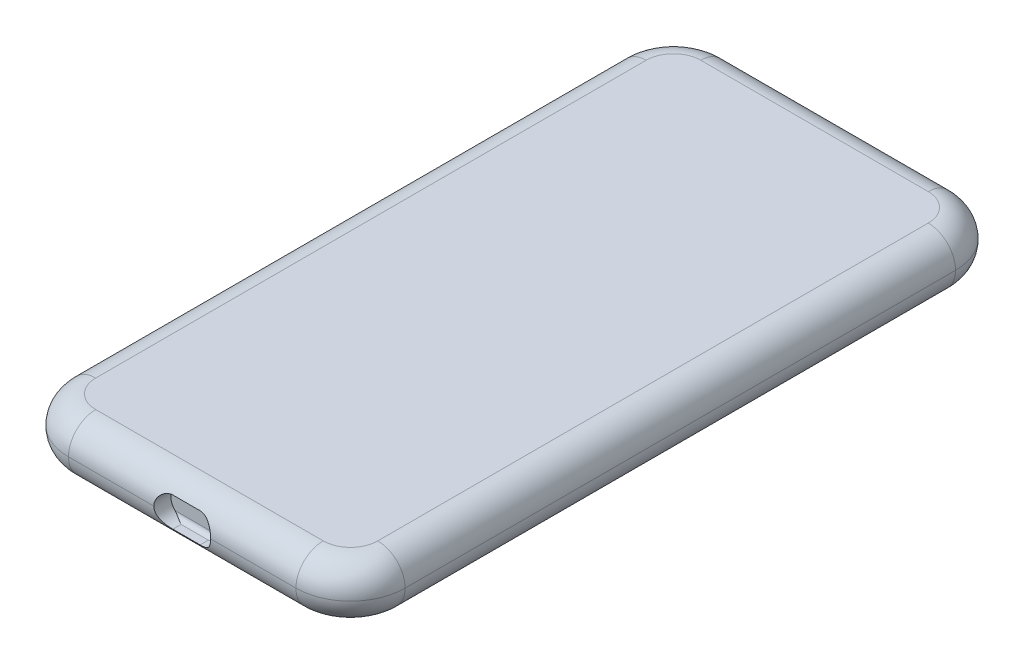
ISO-10303-21;
HEADER;
FILE_DESCRIPTION(('STEP AP214'),'2;1');
FILE_NAME('part.step','',(''),(''),'','','');
FILE_SCHEMA(('AUTOMOTIVE_DESIGN { 1 0 10303 214 1 1 1 1 }'));
ENDSEC;
DATA;
#1=APPLICATION_CONTEXT('core data for automotive mechanical design processes');
#2=APPLICATION_PROTOCOL_DEFINITION('international standard','automotive_design',2000,#1);
#3=PRODUCT_CONTEXT('',#1,'mechanical');
#4=PRODUCT('Part','Part','',(#3));
#5=PRODUCT_RELATED_PRODUCT_CATEGORY('part','',(#4));
#6=PRODUCT_DEFINITION_FORMATION('','',#4);
#7=PRODUCT_DEFINITION_CONTEXT('part definition',#1,'design');
#8=PRODUCT_DEFINITION('design','',#6,#7);
#9=PRODUCT_DEFINITION_SHAPE('','',#8);
#10=(LENGTH_UNIT() NAMED_UNIT(*) SI_UNIT(.MILLI.,.METRE.));
#11=(NAMED_UNIT(*) PLANE_ANGLE_UNIT() SI_UNIT($,.RADIAN.));
#12=(NAMED_UNIT(*) SI_UNIT($,.STERADIAN.) SOLID_ANGLE_UNIT());
#13=UNCERTAINTY_MEASURE_WITH_UNIT(LENGTH_MEASURE(1.E-05),#10,'distance_accuracy_value','');
#14=(GEOMETRIC_REPRESENTATION_CONTEXT(3) GLOBAL_UNCERTAINTY_ASSIGNED_CONTEXT((#13)) GLOBAL_UNIT_ASSIGNED_CONTEXT((#10,
#11,#12)) REPRESENTATION_CONTEXT('',''));
#15=CARTESIAN_POINT('',(0.,0.,0.));
#16=DIRECTION('',(0.,0.,1.));
#17=DIRECTION('',(1.,0.,0.));
#18=AXIS2_PLACEMENT_3D('',#15,#16,#17);
#19=CARTESIAN_POINT('',(0.,6.,0.));
#20=DIRECTION('',(0.,1.,0.));
#21=DIRECTION('',(0.,0.,1.));
#22=AXIS2_PLACEMENT_3D('',#19,#20,#21);
#23=PLANE('',#22);
#24=DIRECTION('',(0.,0.,1.));
#25=VECTOR('',#24,1.);
#26=CARTESIAN_POINT('',(-31.,6.,60.5));
#27=LINE('',#26,#25);
#28=CARTESIAN_POINT('',(-31.,6.,-60.5));
#29=VERTEX_POINT('',#28);
#30=CARTESIAN_POINT('',(-31.,6.,60.5));
#31=VERTEX_POINT('',#30);
#32=EDGE_CURVE('E490',#29,#31,#27,.T.);
#33=ORIENTED_EDGE('',*,*,#32,.T.);
#34=CARTESIAN_POINT('',(-25.,6.,60.5));
#35=DIRECTION('',(0.,1.,0.));
#36=DIRECTION('',(0.,0.,1.));
#37=AXIS2_PLACEMENT_3D('',#34,#35,#36);
#38=CIRCLE('',#37,6.);
#39=CARTESIAN_POINT('',(-25.,6.,66.5));
#40=VERTEX_POINT('',#39);
#41=EDGE_CURVE('E256',#31,#40,#38,.T.);
#42=ORIENTED_EDGE('',*,*,#41,.T.);
#43=DIRECTION('',(1.,0.,0.));
#44=VECTOR('',#43,1.);
#45=CARTESIAN_POINT('',(25.,6.,66.5));
#46=LINE('',#45,#44);
#47=CARTESIAN_POINT('',(25.,6.,66.5));
#48=VERTEX_POINT('',#47);
#49=EDGE_CURVE('E252',#40,#48,#46,.T.);
#50=ORIENTED_EDGE('',*,*,#49,.T.);
#51=CARTESIAN_POINT('',(25.,6.,60.5));
#52=DIRECTION('',(0.,1.,0.));
#53=DIRECTION('',(0.,0.,1.));
#54=AXIS2_PLACEMENT_3D('',#51,#52,#53);
#55=CIRCLE('',#54,6.);
#56=CARTESIAN_POINT('',(31.,6.,60.5));
#57=VERTEX_POINT('',#56);
#58=EDGE_CURVE('E475',#48,#57,#55,.T.);
#59=ORIENTED_EDGE('',*,*,#58,.T.);
#60=DIRECTION('',(0.,0.,1.));
#61=VECTOR('',#60,1.);
#62=CARTESIAN_POINT('',(31.,6.,0.));
#63=LINE('',#62,#61);
#64=CARTESIAN_POINT('',(31.,6.,-60.5));
#65=VERTEX_POINT('',#64);
#66=EDGE_CURVE('E481',#57,#65,#63,.F.);
#67=ORIENTED_EDGE('',*,*,#66,.T.);
#68=CARTESIAN_POINT('',(25.,6.,-60.5));
#69=DIRECTION('',(0.,1.,0.));
#70=DIRECTION('',(0.,0.,1.));
#71=AXIS2_PLACEMENT_3D('',#68,#69,#70);
#72=CIRCLE('',#71,6.);
#73=CARTESIAN_POINT('',(25.,6.,-66.5));
#74=VERTEX_POINT('',#73);
#75=EDGE_CURVE('E482',#65,#74,#72,.T.);
#76=ORIENTED_EDGE('',*,*,#75,.T.);
#77=DIRECTION('',(1.,0.,0.));
#78=VECTOR('',#77,1.);
#79=CARTESIAN_POINT('',(0.,6.,-66.5));
#80=LINE('',#79,#78);
#81=CARTESIAN_POINT('',(-25.,6.,-66.5));
#82=VERTEX_POINT('',#81);
#83=EDGE_CURVE('E486',#74,#82,#80,.F.);
#84=ORIENTED_EDGE('',*,*,#83,.T.);
#85=CARTESIAN_POINT('',(-25.,6.,-60.5));
#86=DIRECTION('',(0.,1.,0.));
#87=DIRECTION('',(0.,0.,1.));
#88=AXIS2_PLACEMENT_3D('',#85,#86,#87);
#89=CIRCLE('',#88,6.);
#90=EDGE_CURVE('E488',#82,#29,#89,.T.);
#91=ORIENTED_EDGE('',*,*,#90,.T.);
#92=EDGE_LOOP('',(#33,#42,#50,#59,#67,#76,#84,#91));
#93=FACE_BOUND('',#92,.T.);
#94=ADVANCED_FACE('F39',(#93),#23,.T.);
#95=CARTESIAN_POINT('',(-25.,0.,60.5));
#96=DIRECTION('',(0.,1.,0.));
#97=DIRECTION('',(0.,0.,1.));
#98=AXIS2_PLACEMENT_3D('',#95,#96,#97);
#99=DEGENERATE_TOROIDAL_SURFACE('',#98,6.,6.,.T.);
#100=CARTESIAN_POINT('',(-25.,0.,66.5));
#101=DIRECTION('',(1.,0.,0.));
#102=DIRECTION('',(0.,0.,-1.));
#103=AXIS2_PLACEMENT_3D('',#100,#101,#102);
#104=CIRCLE('',#103,6.);
#105=CARTESIAN_POINT('',(-25.,0.,72.5));
#106=VERTEX_POINT('',#105);
#107=EDGE_CURVE('E224',#40,#106,#104,.T.);
#108=ORIENTED_EDGE('',*,*,#107,.F.);
#109=ORIENTED_EDGE('',*,*,#41,.F.);
#110=CARTESIAN_POINT('',(-31.,0.,60.5));
#111=DIRECTION('',(0.,0.,-1.));
#112=DIRECTION('',(-1.,0.,0.));
#113=AXIS2_PLACEMENT_3D('',#110,#111,#112);
#114=CIRCLE('',#113,6.);
#115=CARTESIAN_POINT('',(-37.,0.,60.5));
#116=VERTEX_POINT('',#115);
#117=EDGE_CURVE('E249',#116,#31,#114,.T.);
#118=ORIENTED_EDGE('',*,*,#117,.F.);
#119=CARTESIAN_POINT('',(-25.,0.,60.5));
#120=DIRECTION('',(0.,1.,0.));
#121=DIRECTION('',(0.,0.,1.));
#122=AXIS2_PLACEMENT_3D('',#119,#120,#121);
#123=CIRCLE('',#122,12.);
#124=EDGE_CURVE('E246',#106,#116,#123,.F.);
#125=ORIENTED_EDGE('',*,*,#124,.F.);
#126=EDGE_LOOP('',(#108,#109,#118,#125));
#127=FACE_BOUND('',#126,.T.);
#128=ADVANCED_FACE('F396',(#127),#99,.T.);
#129=CARTESIAN_POINT('',(-31.,0.,0.));
#130=DIRECTION('',(0.,0.,-1.));
#131=DIRECTION('',(-1.,0.,0.));
#132=AXIS2_PLACEMENT_3D('',#129,#130,#131);
#133=CYLINDRICAL_SURFACE('',#132,6.);
#134=ORIENTED_EDGE('',*,*,#117,.T.);
#135=ORIENTED_EDGE('',*,*,#32,.F.);
#136=CARTESIAN_POINT('',(-31.,0.,-60.5));
#137=DIRECTION('',(0.,0.,-1.));
#138=DIRECTION('',(-1.,0.,0.));
#139=AXIS2_PLACEMENT_3D('',#136,#137,#138);
#140=CIRCLE('',#139,6.);
#141=CARTESIAN_POINT('',(-37.,0.,-60.5));
#142=VERTEX_POINT('',#141);
#143=EDGE_CURVE('E242',#142,#29,#140,.T.);
#144=ORIENTED_EDGE('',*,*,#143,.F.);
#145=DIRECTION('',(0.,0.,1.));
#146=VECTOR('',#145,1.);
#147=CARTESIAN_POINT('',(-37.,0.,-60.5));
#148=LINE('',#147,#146);
#149=EDGE_CURVE('E239',#116,#142,#148,.F.);
#150=ORIENTED_EDGE('',*,*,#149,.F.);
#151=EDGE_LOOP('',(#134,#135,#144,#150));
#152=FACE_BOUND('',#151,.T.);
#153=ADVANCED_FACE('F392',(#152),#133,.T.);
#154=CARTESIAN_POINT('',(-25.,0.,60.5));
#155=DIRECTION('',(0.,1.,0.));
#156=DIRECTION('',(0.,0.,1.));
#157=AXIS2_PLACEMENT_3D('',#154,#155,#156);
#158=DEGENERATE_TOROIDAL_SURFACE('',#157,6.,6.,.T.);
#159=CARTESIAN_POINT('',(-31.,0.,60.5));
#160=DIRECTION('',(0.,0.,-1.));
#161=DIRECTION('',(-1.,0.,0.));
#162=AXIS2_PLACEMENT_3D('',#159,#160,#161);
#163=CIRCLE('',#162,6.);
#164=CARTESIAN_POINT('',(-34.9686269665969,-4.5,60.5));
#165=VERTEX_POINT('',#164);
#166=EDGE_CURVE('E237',#165,#116,#163,.T.);
#167=ORIENTED_EDGE('',*,*,#166,.F.);
#168=CARTESIAN_POINT('',(-25.,-4.5,60.5));
#169=DIRECTION('',(0.,1.,0.));
#170=DIRECTION('',(0.,0.,1.));
#171=AXIS2_PLACEMENT_3D('',#168,#169,#170);
#172=CIRCLE('',#171,9.96862696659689);
#173=CARTESIAN_POINT('',(-25.,-4.5,70.4686269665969));
#174=VERTEX_POINT('',#173);
#175=EDGE_CURVE('E280',#165,#174,#172,.T.);
#176=ORIENTED_EDGE('',*,*,#175,.T.);
#177=CARTESIAN_POINT('',(-25.,0.,66.5));
#178=DIRECTION('',(1.,0.,0.));
#179=DIRECTION('',(0.,0.,-1.));
#180=AXIS2_PLACEMENT_3D('',#177,#178,#179);
#181=CIRCLE('',#180,6.);
#182=EDGE_CURVE('E230',#106,#174,#181,.T.);
#183=ORIENTED_EDGE('',*,*,#182,.F.);
#184=ORIENTED_EDGE('',*,*,#124,.T.);
#185=EDGE_LOOP('',(#167,#176,#183,#184));
#186=FACE_BOUND('',#185,.T.);
#187=ADVANCED_FACE('F388',(#186),#158,.T.);
#188=CARTESIAN_POINT('',(0.,0.,66.5));
#189=DIRECTION('',(-1.,0.,0.));
#190=DIRECTION('',(0.,0.,1.));
#191=AXIS2_PLACEMENT_3D('',#188,#189,#190);
#192=CYLINDRICAL_SURFACE('',#191,6.);
#193=CARTESIAN_POINT('',(-3.,3.25,71.543560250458));
#194=CARTESIAN_POINT('',(-3.08397667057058,3.2500165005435,71.5435315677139));
#195=CARTESIAN_POINT('',(-3.16793709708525,3.2467458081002,71.5456568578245));
#196=CARTESIAN_POINT('',(-3.33509278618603,3.23376042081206,71.5539985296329));
#197=CARTESIAN_POINT('',(-3.41828857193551,3.22405052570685,71.5602118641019));
#198=CARTESIAN_POINT('',(-3.58275673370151,3.19840294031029,71.5764587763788));
#199=CARTESIAN_POINT('',(-3.6640382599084,3.18250739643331,71.586466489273));
#200=CARTESIAN_POINT('',(-3.82467423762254,3.14471435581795,71.6099184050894));
#201=CARTESIAN_POINT('',(-3.9040284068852,3.12281598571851,71.6233631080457));
#202=CARTESIAN_POINT('',(-4.1380202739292,3.04862058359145,71.6681000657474));
#203=CARTESIAN_POINT('',(-4.28917324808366,2.98772961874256,71.7038584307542));
#204=CARTESIAN_POINT('',(-4.57923612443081,2.8451280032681,71.7831703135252));
#205=CARTESIAN_POINT('',(-4.71812242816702,2.76337835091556,71.8267383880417));
#206=CARTESIAN_POINT('',(-4.99438301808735,2.57211965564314,71.9218686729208));
#207=CARTESIAN_POINT('',(-5.13030409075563,2.46068723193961,71.9737963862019));
#208=CARTESIAN_POINT('',(-5.3826507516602,2.21726516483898,72.076848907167));
#209=CARTESIAN_POINT('',(-5.49906934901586,2.0852681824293,72.1279734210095));
#210=CARTESIAN_POINT('',(-5.71873569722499,1.79090366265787,72.2287614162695));
#211=CARTESIAN_POINT('',(-5.82008087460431,1.62692278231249,72.2779491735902));
#212=CARTESIAN_POINT('',(-5.94971115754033,1.36786641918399,72.3426809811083));
#213=CARTESIAN_POINT('',(-5.98918563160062,1.27934815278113,72.3627475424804));
#214=CARTESIAN_POINT('',(-6.06025855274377,1.09851330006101,72.3993005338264));
#215=CARTESIAN_POINT('',(-6.09186226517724,1.00619930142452,72.4157893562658));
#216=CARTESIAN_POINT('',(-6.14075735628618,0.839039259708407,72.4415088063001));
#217=CARTESIAN_POINT('',(-6.15966713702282,0.764783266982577,72.4515381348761));
#218=CARTESIAN_POINT('',(-6.19223615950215,0.614827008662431,72.4688928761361));
#219=CARTESIAN_POINT('',(-6.20589659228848,0.539127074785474,72.4762189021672));
#220=CARTESIAN_POINT('',(-6.22786414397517,0.386466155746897,72.4880310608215));
#221=CARTESIAN_POINT('',(-6.23615264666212,0.309501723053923,72.4925073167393));
#222=CARTESIAN_POINT('',(-6.24722711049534,0.15502700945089,72.4984981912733));
#223=CARTESIAN_POINT('',(-6.25001042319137,0.0775164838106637,72.5000113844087));
#224=CARTESIAN_POINT('',(-6.25,0.,72.5));
#225=B_SPLINE_CURVE_WITH_KNOTS('',3,(#193,#194,#195,#196,#197,#198,#199,#200,#201,#202,#203,
#204,#205,#206,#207,#208,#209,#210,#211,#212,#213,#214,#215,#216,#217,#218,#219,#220,#221,#222,
#223,#224),.UNSPECIFIED.,.F.,.F.,(4,2,2,2,2,2,2,2,2,2,2,2,2,2,2,4),(0.,0.251812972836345,
0.503438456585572,0.753378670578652,1.00335526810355,1.5015409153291,2.00066498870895,
2.54820000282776,3.09593086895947,3.68924777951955,3.98581455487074,4.28218239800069,
4.51380007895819,4.74536517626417,4.97772852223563,5.21020362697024),.UNSPECIFIED.);
#226=CARTESIAN_POINT('',(-3.,3.25,71.543560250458));
#227=VERTEX_POINT('',#226);
#228=CARTESIAN_POINT('',(-6.25,0.,72.5));
#229=VERTEX_POINT('',#228);
#230=EDGE_CURVE('E195',#227,#229,#225,.T.);
#231=ORIENTED_EDGE('',*,*,#230,.F.);
#232=DIRECTION('',(-1.,0.,0.));
#233=VECTOR('',#232,1.);
#234=CARTESIAN_POINT('',(0.,3.25,71.543560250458));
#235=LINE('',#234,#233);
#236=CARTESIAN_POINT('',(3.,3.25,71.543560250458));
#237=VERTEX_POINT('',#236);
#238=EDGE_CURVE('E218',#237,#227,#235,.T.);
#239=ORIENTED_EDGE('',*,*,#238,.F.);
#240=CARTESIAN_POINT('',(6.25,0.,72.5));
#241=CARTESIAN_POINT('',(6.2500143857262,0.0849012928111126,72.5000159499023));
#242=CARTESIAN_POINT('',(6.24667355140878,0.169792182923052,72.4981983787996));
#243=CARTESIAN_POINT('',(6.23339314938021,0.338868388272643,72.4910161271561));
#244=CARTESIAN_POINT('',(6.22345652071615,0.423054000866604,72.4856530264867));
#245=CARTESIAN_POINT('',(6.19716182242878,0.589694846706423,72.4715347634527));
#246=CARTESIAN_POINT('',(6.18083604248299,0.672156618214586,72.4627966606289));
#247=CARTESIAN_POINT('',(6.14197453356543,0.835180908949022,72.4421575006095));
#248=CARTESIAN_POINT('',(6.11943836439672,0.91574329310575,72.4302562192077));
#249=CARTESIAN_POINT('',(6.04293622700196,1.15355089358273,72.3902495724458));
#250=CARTESIAN_POINT('',(5.98001565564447,1.30729515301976,72.3578074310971));
#251=CARTESIAN_POINT('',(5.83264229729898,1.60182975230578,72.2842281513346));
#252=CARTESIAN_POINT('',(5.74816620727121,1.74260584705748,72.2430816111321));
#253=CARTESIAN_POINT('',(5.55371998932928,2.01772903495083,72.1525300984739));
#254=CARTESIAN_POINT('',(5.44242357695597,2.15101807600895,72.1027570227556));
#255=CARTESIAN_POINT('',(5.20042214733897,2.39804597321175,72.0015671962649));
#256=CARTESIAN_POINT('',(5.06969730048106,2.51176459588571,71.9501488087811));
#257=CARTESIAN_POINT('',(4.77749605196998,2.72744945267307,71.8457186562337));
#258=CARTESIAN_POINT('',(4.61427367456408,2.82724776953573,71.793025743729));
#259=CARTESIAN_POINT('',(4.35668415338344,2.95484308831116,71.7221907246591));
#260=CARTESIAN_POINT('',(4.26874825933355,2.99367546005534,71.6999566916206));
#261=CARTESIAN_POINT('',(4.0890748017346,3.0636069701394,71.6590649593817));
#262=CARTESIAN_POINT('',(3.99734001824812,3.09471165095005,71.640404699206));
#263=CARTESIAN_POINT('',(3.83156235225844,3.14272232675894,71.6111545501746));
#264=CARTESIAN_POINT('',(3.75813679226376,3.16124783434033,71.5996929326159));
#265=CARTESIAN_POINT('',(3.60979280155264,3.19318122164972,71.5797584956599));
#266=CARTESIAN_POINT('',(3.53487478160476,3.20659048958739,71.5712848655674));
#267=CARTESIAN_POINT('',(3.3836013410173,3.22819013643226,71.5575649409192));
#268=CARTESIAN_POINT('',(3.30724053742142,3.23635354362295,71.5523353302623));
#269=CARTESIAN_POINT('',(3.15392340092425,3.24726642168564,71.5453214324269));
#270=CARTESIAN_POINT('',(3.07696668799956,3.25001209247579,71.5435395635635));
#271=CARTESIAN_POINT('',(3.,3.25,71.543560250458));
#272=B_SPLINE_CURVE_WITH_KNOTS('',3,(#240,#241,#242,#243,#244,#245,#246,#247,#248,#249,#250,
#251,#252,#253,#254,#255,#256,#257,#258,#259,#260,#261,#262,#263,#264,#265,#266,#267,#268,#269,
#270,#271),.UNSPECIFIED.,.F.,.F.,(4,2,2,2,2,2,2,2,2,2,2,2,2,2,2,4),(0.,0.254601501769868,
0.509089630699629,0.762307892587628,1.01554410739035,1.5208762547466,2.02675703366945,
2.56643902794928,3.10667567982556,3.69864074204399,3.99428942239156,4.28972544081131,
4.51926984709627,4.74875192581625,4.97940464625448,5.21021909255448),.UNSPECIFIED.);
#273=CARTESIAN_POINT('',(6.25,0.,72.5));
#274=VERTEX_POINT('',#273);
#275=EDGE_CURVE('E208',#274,#237,#272,.T.);
#276=ORIENTED_EDGE('',*,*,#275,.F.);
#277=DIRECTION('',(1.,0.,0.));
#278=VECTOR('',#277,1.);
#279=CARTESIAN_POINT('',(-25.,0.,72.5));
#280=LINE('',#279,#278);
#281=CARTESIAN_POINT('',(25.,0.,72.5));
#282=VERTEX_POINT('',#281);
#283=EDGE_CURVE('E226',#282,#274,#280,.F.);
#284=ORIENTED_EDGE('',*,*,#283,.F.);
#285=CARTESIAN_POINT('',(25.,0.,66.5));
#286=DIRECTION('',(1.,0.,0.));
#287=DIRECTION('',(0.,0.,-1.));
#288=AXIS2_PLACEMENT_3D('',#285,#286,#287);
#289=CIRCLE('',#288,6.);
#290=EDGE_CURVE('E227',#48,#282,#289,.T.);
#291=ORIENTED_EDGE('',*,*,#290,.F.);
#292=ORIENTED_EDGE('',*,*,#49,.F.);
#293=ORIENTED_EDGE('',*,*,#107,.T.);
#294=EDGE_CURVE('E213',#229,#106,#280,.F.);
#295=ORIENTED_EDGE('',*,*,#294,.F.);
#296=EDGE_LOOP('',(#231,#239,#276,#284,#291,#292,#293,#295));
#297=FACE_BOUND('',#296,.T.);
#298=ADVANCED_FACE('F222',(#297),#192,.T.);
#299=CARTESIAN_POINT('',(-25.,0.,-60.5));
#300=DIRECTION('',(0.,1.,0.));
#301=DIRECTION('',(0.,0.,1.));
#302=AXIS2_PLACEMENT_3D('',#299,#300,#301);
#303=DEGENERATE_TOROIDAL_SURFACE('',#302,6.,6.,.T.);
#304=ORIENTED_EDGE('',*,*,#143,.T.);
#305=ORIENTED_EDGE('',*,*,#90,.F.);
#306=CARTESIAN_POINT('',(-25.,0.,-66.5));
#307=DIRECTION('',(1.,0.,0.));
#308=DIRECTION('',(0.,0.,-1.));
#309=AXIS2_PLACEMENT_3D('',#306,#307,#308);
#310=CIRCLE('',#309,6.);
#311=CARTESIAN_POINT('',(-25.,0.,-72.5));
#312=VERTEX_POINT('',#311);
#313=EDGE_CURVE('E232',#312,#82,#310,.T.);
#314=ORIENTED_EDGE('',*,*,#313,.F.);
#315=CARTESIAN_POINT('',(-25.,0.,-60.5));
#316=DIRECTION('',(0.,1.,0.));
#317=DIRECTION('',(0.,0.,1.));
#318=AXIS2_PLACEMENT_3D('',#315,#316,#317);
#319=CIRCLE('',#318,12.);
#320=EDGE_CURVE('E526',#142,#312,#319,.F.);
#321=ORIENTED_EDGE('',*,*,#320,.F.);
#322=EDGE_LOOP('',(#304,#305,#314,#321));
#323=FACE_BOUND('',#322,.T.);
#324=ADVANCED_FACE('F387',(#323),#303,.T.);
#325=CARTESIAN_POINT('',(-31.,0.,-72.5));
#326=DIRECTION('',(0.,0.,1.));
#327=DIRECTION('',(1.,0.,0.));
#328=AXIS2_PLACEMENT_3D('',#325,#326,#327);
#329=CYLINDRICAL_SURFACE('',#328,6.);
#330=CARTESIAN_POINT('',(-31.,0.,-60.5));
#331=DIRECTION('',(0.,0.,-1.));
#332=DIRECTION('',(-1.,0.,0.));
#333=AXIS2_PLACEMENT_3D('',#330,#331,#332);
#334=CIRCLE('',#333,6.);
#335=CARTESIAN_POINT('',(-34.9686269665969,-4.5,-60.5));
#336=VERTEX_POINT('',#335);
#337=EDGE_CURVE('E524',#336,#142,#334,.T.);
#338=ORIENTED_EDGE('',*,*,#337,.F.);
#339=DIRECTION('',(0.,0.,1.));
#340=VECTOR('',#339,1.);
#341=CARTESIAN_POINT('',(-34.9686269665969,-4.5,-72.5));
#342=LINE('',#341,#340);
#343=EDGE_CURVE('E278',#336,#165,#342,.T.);
#344=ORIENTED_EDGE('',*,*,#343,.T.);
#345=ORIENTED_EDGE('',*,*,#166,.T.);
#346=ORIENTED_EDGE('',*,*,#149,.T.);
#347=EDGE_LOOP('',(#338,#344,#345,#346));
#348=FACE_BOUND('',#347,.T.);
#349=ADVANCED_FACE('F472',(#348),#329,.T.);
#350=CARTESIAN_POINT('',(-37.,0.,66.5));
#351=DIRECTION('',(1.,0.,0.));
#352=DIRECTION('',(0.,0.,-1.));
#353=AXIS2_PLACEMENT_3D('',#350,#351,#352);
#354=CYLINDRICAL_SURFACE('',#353,6.);
#355=CARTESIAN_POINT('',(-6.25,0.,72.5));
#356=CARTESIAN_POINT('',(-6.2500143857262,-0.0849012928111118,72.5000159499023));
#357=CARTESIAN_POINT('',(-6.24667355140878,-0.169792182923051,72.4981983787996));
#358=CARTESIAN_POINT('',(-6.23339314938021,-0.338868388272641,72.4910161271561));
#359=CARTESIAN_POINT('',(-6.22345652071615,-0.423054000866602,72.4856530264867));
#360=CARTESIAN_POINT('',(-6.19716182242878,-0.589694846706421,72.4715347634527));
#361=CARTESIAN_POINT('',(-6.18083604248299,-0.672156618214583,72.4627966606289));
#362=CARTESIAN_POINT('',(-6.14197453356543,-0.83518090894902,72.4421575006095));
#363=CARTESIAN_POINT('',(-6.11943836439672,-0.915743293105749,72.4302562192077));
#364=CARTESIAN_POINT('',(-6.04293622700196,-1.15355089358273,72.3902495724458));
#365=CARTESIAN_POINT('',(-5.98001565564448,-1.30729515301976,72.3578074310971));
#366=CARTESIAN_POINT('',(-5.83264229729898,-1.60182975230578,72.2842281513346));
#367=CARTESIAN_POINT('',(-5.74816620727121,-1.74260584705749,72.2430816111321));
#368=CARTESIAN_POINT('',(-5.55371998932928,-2.01772903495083,72.152530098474));
#369=CARTESIAN_POINT('',(-5.44242357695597,-2.15101807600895,72.1027570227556));
#370=CARTESIAN_POINT('',(-5.20042214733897,-2.39804597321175,72.0015671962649));
#371=CARTESIAN_POINT('',(-5.06969730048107,-2.51176459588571,71.9501488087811));
#372=CARTESIAN_POINT('',(-4.77749605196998,-2.72744945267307,71.8457186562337));
#373=CARTESIAN_POINT('',(-4.61427367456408,-2.82724776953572,71.793025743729));
#374=CARTESIAN_POINT('',(-4.35668415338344,-2.95484308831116,71.7221907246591));
#375=CARTESIAN_POINT('',(-4.26874825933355,-2.99367546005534,71.6999566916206));
#376=CARTESIAN_POINT('',(-4.0890748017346,-3.0636069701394,71.6590649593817));
#377=CARTESIAN_POINT('',(-3.99734001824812,-3.09471165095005,71.640404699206));
#378=CARTESIAN_POINT('',(-3.83156235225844,-3.14272232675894,71.6111545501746));
#379=CARTESIAN_POINT('',(-3.75813679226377,-3.16124783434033,71.5996929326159));
#380=CARTESIAN_POINT('',(-3.60979280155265,-3.19318122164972,71.5797584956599));
#381=CARTESIAN_POINT('',(-3.53487478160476,-3.20659048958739,71.5712848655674));
#382=CARTESIAN_POINT('',(-3.3836013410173,-3.22819013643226,71.5575649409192));
#383=CARTESIAN_POINT('',(-3.30724053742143,-3.23635354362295,71.5523353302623));
#384=CARTESIAN_POINT('',(-3.15392340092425,-3.24726642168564,71.5453214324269));
#385=CARTESIAN_POINT('',(-3.07696668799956,-3.25001209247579,71.5435395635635));
#386=CARTESIAN_POINT('',(-3.,-3.25,71.543560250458));
#387=B_SPLINE_CURVE_WITH_KNOTS('',3,(#355,#356,#357,#358,#359,#360,#361,#362,#363,#364,#365,
#366,#367,#368,#369,#370,#371,#372,#373,#374,#375,#376,#377,#378,#379,#380,#381,#382,#383,#384,
#385,#386),.UNSPECIFIED.,.F.,.F.,(4,2,2,2,2,2,2,2,2,2,2,2,2,2,2,4),(0.,0.254601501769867,
0.509089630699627,0.762307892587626,1.01554410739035,1.5208762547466,2.02675703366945,
2.56643902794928,3.10667567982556,3.69864074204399,3.99428942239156,4.28972544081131,
4.51926984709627,4.74875192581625,4.97940464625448,5.21021909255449),.UNSPECIFIED.);
#388=CARTESIAN_POINT('',(-3.,-3.25,71.543560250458));
#389=VERTEX_POINT('',#388);
#390=EDGE_CURVE('E200',#229,#389,#387,.T.);
#391=ORIENTED_EDGE('',*,*,#390,.F.);
#392=ORIENTED_EDGE('',*,*,#294,.T.);
#393=ORIENTED_EDGE('',*,*,#182,.T.);
#394=DIRECTION('',(1.,0.,0.));
#395=VECTOR('',#394,1.);
#396=CARTESIAN_POINT('',(-37.,-4.5,70.4686269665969));
#397=LINE('',#396,#395);
#398=CARTESIAN_POINT('',(25.,-4.49999999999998,70.4686269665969));
#399=VERTEX_POINT('',#398);
#400=EDGE_CURVE('E282',#174,#399,#397,.T.);
#401=ORIENTED_EDGE('',*,*,#400,.T.);
#402=CARTESIAN_POINT('',(25.,0.,66.5));
#403=DIRECTION('',(1.,0.,0.));
#404=DIRECTION('',(0.,0.,-1.));
#405=AXIS2_PLACEMENT_3D('',#402,#403,#404);
#406=CIRCLE('',#405,6.);
#407=EDGE_CURVE('E521',#282,#399,#406,.T.);
#408=ORIENTED_EDGE('',*,*,#407,.F.);
#409=ORIENTED_EDGE('',*,*,#283,.T.);
#410=CARTESIAN_POINT('',(3.,-3.25,71.543560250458));
#411=CARTESIAN_POINT('',(3.08397667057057,-3.2500165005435,71.5435315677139));
#412=CARTESIAN_POINT('',(3.16793709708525,-3.2467458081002,71.5456568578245));
#413=CARTESIAN_POINT('',(3.33509278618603,-3.23376042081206,71.5539985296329));
#414=CARTESIAN_POINT('',(3.41828857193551,-3.22405052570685,71.5602118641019));
#415=CARTESIAN_POINT('',(3.5827567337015,-3.19840294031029,71.5764587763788));
#416=CARTESIAN_POINT('',(3.66403825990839,-3.18250739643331,71.586466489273));
#417=CARTESIAN_POINT('',(3.82467423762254,-3.14471435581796,71.6099184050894));
#418=CARTESIAN_POINT('',(3.90402840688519,-3.12281598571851,71.6233631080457));
#419=CARTESIAN_POINT('',(4.1380202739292,-3.04862058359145,71.6681000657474));
#420=CARTESIAN_POINT('',(4.28917324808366,-2.98772961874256,71.7038584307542));
#421=CARTESIAN_POINT('',(4.57923612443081,-2.8451280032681,71.7831703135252));
#422=CARTESIAN_POINT('',(4.71812242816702,-2.76337835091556,71.8267383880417));
#423=CARTESIAN_POINT('',(4.99438301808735,-2.57211965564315,71.9218686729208));
#424=CARTESIAN_POINT('',(5.13030409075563,-2.46068723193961,71.9737963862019));
#425=CARTESIAN_POINT('',(5.3826507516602,-2.21726516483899,72.076848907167));
#426=CARTESIAN_POINT('',(5.49906934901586,-2.0852681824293,72.1279734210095));
#427=CARTESIAN_POINT('',(5.71873569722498,-1.79090366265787,72.2287614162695));
#428=CARTESIAN_POINT('',(5.82008087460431,-1.6269227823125,72.2779491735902));
#429=CARTESIAN_POINT('',(5.94971115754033,-1.36786641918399,72.3426809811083));
#430=CARTESIAN_POINT('',(5.98918563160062,-1.27934815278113,72.3627475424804));
#431=CARTESIAN_POINT('',(6.06025855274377,-1.09851330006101,72.3993005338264));
#432=CARTESIAN_POINT('',(6.09186226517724,-1.00619930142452,72.4157893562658));
#433=CARTESIAN_POINT('',(6.14075735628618,-0.839039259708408,72.4415088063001));
#434=CARTESIAN_POINT('',(6.15966713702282,-0.764783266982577,72.4515381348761));
#435=CARTESIAN_POINT('',(6.19223615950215,-0.61482700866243,72.4688928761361));
#436=CARTESIAN_POINT('',(6.20589659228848,-0.539127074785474,72.4762189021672));
#437=CARTESIAN_POINT('',(6.22786414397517,-0.386466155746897,72.4880310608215));
#438=CARTESIAN_POINT('',(6.23615264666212,-0.309501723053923,72.4925073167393));
#439=CARTESIAN_POINT('',(6.24722711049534,-0.15502700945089,72.4984981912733));
#440=CARTESIAN_POINT('',(6.25001042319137,-0.0775164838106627,72.5000113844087));
#441=CARTESIAN_POINT('',(6.25,0.,72.5));
#442=B_SPLINE_CURVE_WITH_KNOTS('',3,(#410,#411,#412,#413,#414,#415,#416,#417,#418,#419,#420,
#421,#422,#423,#424,#425,#426,#427,#428,#429,#430,#431,#432,#433,#434,#435,#436,#437,#438,#439,
#440,#441),.UNSPECIFIED.,.F.,.F.,(4,2,2,2,2,2,2,2,2,2,2,2,2,2,2,4),(0.,0.251812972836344,
0.503438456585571,0.753378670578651,1.00335526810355,1.5015409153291,2.00066498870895,
2.54820000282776,3.09593086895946,3.68924777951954,3.98581455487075,4.28218239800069,
4.51380007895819,4.74536517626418,4.97772852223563,5.21020362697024),.UNSPECIFIED.);
#443=CARTESIAN_POINT('',(3.,-3.25,71.543560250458));
#444=VERTEX_POINT('',#443);
#445=EDGE_CURVE('E219',#444,#274,#442,.T.);
#446=ORIENTED_EDGE('',*,*,#445,.F.);
#447=DIRECTION('',(1.,0.,0.));
#448=VECTOR('',#447,1.);
#449=CARTESIAN_POINT('',(-37.,-3.25,71.543560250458));
#450=LINE('',#449,#448);
#451=EDGE_CURVE('E217',#389,#444,#450,.T.);
#452=ORIENTED_EDGE('',*,*,#451,.F.);
#453=EDGE_LOOP('',(#391,#392,#393,#401,#408,#409,#446,#452));
#454=FACE_BOUND('',#453,.T.);
#455=ADVANCED_FACE('F211',(#454),#354,.T.);
#456=CARTESIAN_POINT('',(25.,0.,60.5));
#457=DIRECTION('',(0.,1.,0.));
#458=DIRECTION('',(0.,0.,1.));
#459=AXIS2_PLACEMENT_3D('',#456,#457,#458);
#460=DEGENERATE_TOROIDAL_SURFACE('',#459,6.,6.,.T.);
#461=ORIENTED_EDGE('',*,*,#58,.F.);
#462=ORIENTED_EDGE('',*,*,#290,.T.);
#463=CARTESIAN_POINT('',(25.,0.,60.5));
#464=DIRECTION('',(0.,1.,0.));
#465=DIRECTION('',(0.,0.,1.));
#466=AXIS2_PLACEMENT_3D('',#463,#464,#465);
#467=CIRCLE('',#466,12.);
#468=CARTESIAN_POINT('',(37.,0.,60.5));
#469=VERTEX_POINT('',#468);
#470=EDGE_CURVE('E518',#469,#282,#467,.F.);
#471=ORIENTED_EDGE('',*,*,#470,.F.);
#472=CARTESIAN_POINT('',(31.,0.,60.5));
#473=DIRECTION('',(0.,0.,-1.));
#474=DIRECTION('',(-1.,0.,0.));
#475=AXIS2_PLACEMENT_3D('',#472,#473,#474);
#476=CIRCLE('',#475,6.);
#477=EDGE_CURVE('E479',#57,#469,#476,.T.);
#478=ORIENTED_EDGE('',*,*,#477,.F.);
#479=EDGE_LOOP('',(#461,#462,#471,#478));
#480=FACE_BOUND('',#479,.T.);
#481=ADVANCED_FACE('F465',(#480),#460,.T.);
#482=CARTESIAN_POINT('',(-37.,0.,-66.5));
#483=DIRECTION('',(1.,0.,0.));
#484=DIRECTION('',(0.,0.,-1.));
#485=AXIS2_PLACEMENT_3D('',#482,#483,#484);
#486=CYLINDRICAL_SURFACE('',#485,6.);
#487=ORIENTED_EDGE('',*,*,#313,.T.);
#488=ORIENTED_EDGE('',*,*,#83,.F.);
#489=CARTESIAN_POINT('',(25.,0.,-66.5));
#490=DIRECTION('',(1.,0.,0.));
#491=DIRECTION('',(0.,0.,-1.));
#492=AXIS2_PLACEMENT_3D('',#489,#490,#491);
#493=CIRCLE('',#492,6.);
#494=CARTESIAN_POINT('',(25.,0.,-72.5));
#495=VERTEX_POINT('',#494);
#496=EDGE_CURVE('E512',#495,#74,#493,.T.);
#497=ORIENTED_EDGE('',*,*,#496,.F.);
#498=DIRECTION('',(1.,0.,0.));
#499=VECTOR('',#498,1.);
#500=CARTESIAN_POINT('',(-37.,0.,-72.5));
#501=LINE('',#500,#499);
#502=EDGE_CURVE('E509',#312,#495,#501,.T.);
#503=ORIENTED_EDGE('',*,*,#502,.F.);
#504=EDGE_LOOP('',(#487,#488,#497,#503));
#505=FACE_BOUND('',#504,.T.);
#506=ADVANCED_FACE('F462',(#505),#486,.T.);
#507=CARTESIAN_POINT('',(-25.,0.,-60.5));
#508=DIRECTION('',(0.,1.,0.));
#509=DIRECTION('',(0.,0.,1.));
#510=AXIS2_PLACEMENT_3D('',#507,#508,#509);
#511=DEGENERATE_TOROIDAL_SURFACE('',#510,6.,6.,.T.);
#512=CARTESIAN_POINT('',(-25.,0.,-66.5));
#513=DIRECTION('',(1.,0.,0.));
#514=DIRECTION('',(0.,0.,-1.));
#515=AXIS2_PLACEMENT_3D('',#512,#513,#514);
#516=CIRCLE('',#515,6.);
#517=CARTESIAN_POINT('',(-25.,-4.50000000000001,-70.4686269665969));
#518=VERTEX_POINT('',#517);
#519=EDGE_CURVE('E507',#518,#312,#516,.T.);
#520=ORIENTED_EDGE('',*,*,#519,.F.);
#521=CARTESIAN_POINT('',(-25.,-4.5,-60.5));
#522=DIRECTION('',(0.,1.,0.));
#523=DIRECTION('',(0.,0.,1.));
#524=AXIS2_PLACEMENT_3D('',#521,#522,#523);
#525=CIRCLE('',#524,9.96862696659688);
#526=EDGE_CURVE('E276',#518,#336,#525,.T.);
#527=ORIENTED_EDGE('',*,*,#526,.T.);
#528=ORIENTED_EDGE('',*,*,#337,.T.);
#529=ORIENTED_EDGE('',*,*,#320,.T.);
#530=EDGE_LOOP('',(#520,#527,#528,#529));
#531=FACE_BOUND('',#530,.T.);
#532=ADVANCED_FACE('F458',(#531),#511,.T.);
#533=CARTESIAN_POINT('',(25.,0.,60.5));
#534=DIRECTION('',(0.,1.,0.));
#535=DIRECTION('',(0.,0.,1.));
#536=AXIS2_PLACEMENT_3D('',#533,#534,#535);
#537=DEGENERATE_TOROIDAL_SURFACE('',#536,6.,6.,.T.);
#538=ORIENTED_EDGE('',*,*,#407,.T.);
#539=CARTESIAN_POINT('',(25.,-4.5,60.5));
#540=DIRECTION('',(0.,1.,0.));
#541=DIRECTION('',(0.,0.,1.));
#542=AXIS2_PLACEMENT_3D('',#539,#540,#541);
#543=CIRCLE('',#542,9.96862696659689);
#544=CARTESIAN_POINT('',(34.9686269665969,-4.5,60.5));
#545=VERTEX_POINT('',#544);
#546=EDGE_CURVE('E284',#399,#545,#543,.T.);
#547=ORIENTED_EDGE('',*,*,#546,.T.);
#548=CARTESIAN_POINT('',(31.,0.,60.5));
#549=DIRECTION('',(0.,0.,-1.));
#550=DIRECTION('',(-1.,0.,0.));
#551=AXIS2_PLACEMENT_3D('',#548,#549,#550);
#552=CIRCLE('',#551,6.);
#553=EDGE_CURVE('E504',#469,#545,#552,.T.);
#554=ORIENTED_EDGE('',*,*,#553,.F.);
#555=ORIENTED_EDGE('',*,*,#470,.T.);
#556=EDGE_LOOP('',(#538,#547,#554,#555));
#557=FACE_BOUND('',#556,.T.);
#558=ADVANCED_FACE('F454',(#557),#537,.T.);
#559=CARTESIAN_POINT('',(31.,0.,-72.5));
#560=DIRECTION('',(0.,0.,1.));
#561=DIRECTION('',(1.,0.,0.));
#562=AXIS2_PLACEMENT_3D('',#559,#560,#561);
#563=CYLINDRICAL_SURFACE('',#562,6.);
#564=CARTESIAN_POINT('',(31.,0.,-60.5));
#565=DIRECTION('',(0.,0.,-1.));
#566=DIRECTION('',(-1.,0.,0.));
#567=AXIS2_PLACEMENT_3D('',#564,#565,#566);
#568=CIRCLE('',#567,6.);
#569=CARTESIAN_POINT('',(37.,0.,-60.5));
#570=VERTEX_POINT('',#569);
#571=EDGE_CURVE('E515',#65,#570,#568,.T.);
#572=ORIENTED_EDGE('',*,*,#571,.F.);
#573=ORIENTED_EDGE('',*,*,#66,.F.);
#574=ORIENTED_EDGE('',*,*,#477,.T.);
#575=DIRECTION('',(0.,0.,1.));
#576=VECTOR('',#575,1.);
#577=CARTESIAN_POINT('',(37.,0.,-72.5));
#578=LINE('',#577,#576);
#579=EDGE_CURVE('E501',#570,#469,#578,.T.);
#580=ORIENTED_EDGE('',*,*,#579,.F.);
#581=EDGE_LOOP('',(#572,#573,#574,#580));
#582=FACE_BOUND('',#581,.T.);
#583=ADVANCED_FACE('F450',(#582),#563,.T.);
#584=CARTESIAN_POINT('',(25.,0.,-60.5));
#585=DIRECTION('',(0.,1.,0.));
#586=DIRECTION('',(0.,0.,1.));
#587=AXIS2_PLACEMENT_3D('',#584,#585,#586);
#588=DEGENERATE_TOROIDAL_SURFACE('',#587,6.,6.,.T.);
#589=ORIENTED_EDGE('',*,*,#75,.F.);
#590=ORIENTED_EDGE('',*,*,#571,.T.);
#591=CARTESIAN_POINT('',(25.,0.,-60.5));
#592=DIRECTION('',(0.,1.,0.));
#593=DIRECTION('',(0.,0.,1.));
#594=AXIS2_PLACEMENT_3D('',#591,#592,#593);
#595=CIRCLE('',#594,12.);
#596=EDGE_CURVE('E498',#495,#570,#595,.F.);
#597=ORIENTED_EDGE('',*,*,#596,.F.);
#598=ORIENTED_EDGE('',*,*,#496,.T.);
#599=EDGE_LOOP('',(#589,#590,#597,#598));
#600=FACE_BOUND('',#599,.T.);
#601=ADVANCED_FACE('F446',(#600),#588,.T.);
#602=CARTESIAN_POINT('',(0.,0.,-66.5));
#603=DIRECTION('',(-1.,0.,0.));
#604=DIRECTION('',(0.,0.,1.));
#605=AXIS2_PLACEMENT_3D('',#602,#603,#604);
#606=CYLINDRICAL_SURFACE('',#605,6.);
#607=CARTESIAN_POINT('',(25.,0.,-66.5));
#608=DIRECTION('',(1.,0.,0.));
#609=DIRECTION('',(0.,0.,-1.));
#610=AXIS2_PLACEMENT_3D('',#607,#608,#609);
#611=CIRCLE('',#610,6.);
#612=CARTESIAN_POINT('',(25.,-4.5,-70.4686269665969));
#613=VERTEX_POINT('',#612);
#614=EDGE_CURVE('E496',#613,#495,#611,.T.);
#615=ORIENTED_EDGE('',*,*,#614,.F.);
#616=DIRECTION('',(-1.,0.,0.));
#617=VECTOR('',#616,1.);
#618=CARTESIAN_POINT('',(0.,-4.5,-70.4686269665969));
#619=LINE('',#618,#617);
#620=EDGE_CURVE('E274',#613,#518,#619,.T.);
#621=ORIENTED_EDGE('',*,*,#620,.T.);
#622=ORIENTED_EDGE('',*,*,#519,.T.);
#623=ORIENTED_EDGE('',*,*,#502,.T.);
#624=EDGE_LOOP('',(#615,#621,#622,#623));
#625=FACE_BOUND('',#624,.T.);
#626=ADVANCED_FACE('F442',(#625),#606,.T.);
#627=CARTESIAN_POINT('',(31.,0.,0.));
#628=DIRECTION('',(0.,0.,-1.));
#629=DIRECTION('',(-1.,0.,0.));
#630=AXIS2_PLACEMENT_3D('',#627,#628,#629);
#631=CYLINDRICAL_SURFACE('',#630,6.);
#632=ORIENTED_EDGE('',*,*,#553,.T.);
#633=DIRECTION('',(0.,0.,-1.));
#634=VECTOR('',#633,1.);
#635=CARTESIAN_POINT('',(34.9686269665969,-4.5,0.));
#636=LINE('',#635,#634);
#637=CARTESIAN_POINT('',(34.9686269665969,-4.5,-60.5));
#638=VERTEX_POINT('',#637);
#639=EDGE_CURVE('E286',#545,#638,#636,.T.);
#640=ORIENTED_EDGE('',*,*,#639,.T.);
#641=CARTESIAN_POINT('',(31.,0.,-60.5));
#642=DIRECTION('',(0.,0.,-1.));
#643=DIRECTION('',(-1.,0.,0.));
#644=AXIS2_PLACEMENT_3D('',#641,#642,#643);
#645=CIRCLE('',#644,6.);
#646=EDGE_CURVE('E309',#570,#638,#645,.T.);
#647=ORIENTED_EDGE('',*,*,#646,.F.);
#648=ORIENTED_EDGE('',*,*,#579,.T.);
#649=EDGE_LOOP('',(#632,#640,#647,#648));
#650=FACE_BOUND('',#649,.T.);
#651=ADVANCED_FACE('F438',(#650),#631,.T.);
#652=CARTESIAN_POINT('',(25.,0.,-60.5));
#653=DIRECTION('',(0.,1.,0.));
#654=DIRECTION('',(0.,0.,1.));
#655=AXIS2_PLACEMENT_3D('',#652,#653,#654);
#656=DEGENERATE_TOROIDAL_SURFACE('',#655,6.,6.,.T.);
#657=ORIENTED_EDGE('',*,*,#646,.T.);
#658=CARTESIAN_POINT('',(25.,-4.5,-60.5));
#659=DIRECTION('',(0.,1.,0.));
#660=DIRECTION('',(0.,0.,1.));
#661=AXIS2_PLACEMENT_3D('',#658,#659,#660);
#662=CIRCLE('',#661,9.96862696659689);
#663=EDGE_CURVE('E271',#638,#613,#662,.T.);
#664=ORIENTED_EDGE('',*,*,#663,.T.);
#665=ORIENTED_EDGE('',*,*,#614,.T.);
#666=ORIENTED_EDGE('',*,*,#596,.T.);
#667=EDGE_LOOP('',(#657,#664,#665,#666));
#668=FACE_BOUND('',#667,.T.);
#669=ADVANCED_FACE('F435',(#668),#656,.T.);
#670=CARTESIAN_POINT('',(0.,-5.,0.));
#671=DIRECTION('',(0.,1.,0.));
#672=DIRECTION('',(0.,0.,1.));
#673=AXIS2_PLACEMENT_3D('',#670,#671,#672);
#674=PLANE('',#673);
#675=DIRECTION('',(1.,0.,0.));
#676=VECTOR('',#675,1.);
#677=CARTESIAN_POINT('',(25.,-5.,-69.1457513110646));
#678=LINE('',#677,#676);
#679=CARTESIAN_POINT('',(-25.,-5.,-69.1457513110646));
#680=VERTEX_POINT('',#679);
#681=CARTESIAN_POINT('',(25.,-5.,-69.1457513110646));
#682=VERTEX_POINT('',#681);
#683=EDGE_CURVE('E266',#680,#682,#678,.T.);
#684=ORIENTED_EDGE('',*,*,#683,.T.);
#685=CARTESIAN_POINT('',(25.,-5.,-60.5));
#686=DIRECTION('',(0.,1.,0.));
#687=DIRECTION('',(0.,0.,1.));
#688=AXIS2_PLACEMENT_3D('',#685,#686,#687);
#689=CIRCLE('',#688,8.64575131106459);
#690=CARTESIAN_POINT('',(33.6457513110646,-5.,-60.5));
#691=VERTEX_POINT('',#690);
#692=EDGE_CURVE('E268',#682,#691,#689,.F.);
#693=ORIENTED_EDGE('',*,*,#692,.T.);
#694=DIRECTION('',(0.,0.,1.));
#695=VECTOR('',#694,1.);
#696=CARTESIAN_POINT('',(33.6457513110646,-5.,60.5));
#697=LINE('',#696,#695);
#698=CARTESIAN_POINT('',(33.6457513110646,-5.,60.5));
#699=VERTEX_POINT('',#698);
#700=EDGE_CURVE('E253',#691,#699,#697,.T.);
#701=ORIENTED_EDGE('',*,*,#700,.T.);
#702=CARTESIAN_POINT('',(25.,-5.,60.5));
#703=DIRECTION('',(0.,1.,0.));
#704=DIRECTION('',(0.,0.,1.));
#705=AXIS2_PLACEMENT_3D('',#702,#703,#704);
#706=CIRCLE('',#705,8.64575131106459);
#707=CARTESIAN_POINT('',(25.,-5.,69.1457513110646));
#708=VERTEX_POINT('',#707);
#709=EDGE_CURVE('E255',#699,#708,#706,.F.);
#710=ORIENTED_EDGE('',*,*,#709,.T.);
#711=DIRECTION('',(-1.,0.,0.));
#712=VECTOR('',#711,1.);
#713=CARTESIAN_POINT('',(-25.,-5.,69.1457513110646));
#714=LINE('',#713,#712);
#715=CARTESIAN_POINT('',(-25.,-5.,69.1457513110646));
#716=VERTEX_POINT('',#715);
#717=EDGE_CURVE('E258',#708,#716,#714,.T.);
#718=ORIENTED_EDGE('',*,*,#717,.T.);
#719=CARTESIAN_POINT('',(-25.,-5.,60.5));
#720=DIRECTION('',(0.,1.,0.));
#721=DIRECTION('',(0.,0.,1.));
#722=AXIS2_PLACEMENT_3D('',#719,#720,#721);
#723=CIRCLE('',#722,8.64575131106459);
#724=CARTESIAN_POINT('',(-33.6457513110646,-5.,60.5));
#725=VERTEX_POINT('',#724);
#726=EDGE_CURVE('E260',#716,#725,#723,.F.);
#727=ORIENTED_EDGE('',*,*,#726,.T.);
#728=DIRECTION('',(0.,0.,-1.));
#729=VECTOR('',#728,1.);
#730=CARTESIAN_POINT('',(-33.6457513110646,-5.,-60.5));
#731=LINE('',#730,#729);
#732=CARTESIAN_POINT('',(-33.6457513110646,-5.,-60.5));
#733=VERTEX_POINT('',#732);
#734=EDGE_CURVE('E262',#725,#733,#731,.T.);
#735=ORIENTED_EDGE('',*,*,#734,.T.);
#736=CARTESIAN_POINT('',(-25.,-5.,-60.5));
#737=DIRECTION('',(0.,1.,0.));
#738=DIRECTION('',(0.,0.,1.));
#739=AXIS2_PLACEMENT_3D('',#736,#737,#738);
#740=CIRCLE('',#739,8.64575131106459);
#741=EDGE_CURVE('E264',#733,#680,#740,.F.);
#742=ORIENTED_EDGE('',*,*,#741,.T.);
#743=EDGE_LOOP('',(#684,#693,#701,#710,#718,#727,#735,#742));
#744=FACE_BOUND('',#743,.T.);
#745=ADVANCED_FACE('F373',(#744),#674,.F.);
#746=CARTESIAN_POINT('',(-25.,-3.,60.5));
#747=DIRECTION('',(0.,1.,0.));
#748=DIRECTION('',(0.,0.,1.));
#749=AXIS2_PLACEMENT_3D('',#746,#747,#748);
#750=TOROIDAL_SURFACE('',#749,8.64575131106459,2.);
#751=CARTESIAN_POINT('',(-25.,-3.,69.1457513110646));
#752=DIRECTION('',(1.,0.,0.));
#753=DIRECTION('',(0.,0.,-1.));
#754=AXIS2_PLACEMENT_3D('',#751,#752,#753);
#755=CIRCLE('',#754,2.);
#756=EDGE_CURVE('E303',#174,#716,#755,.T.);
#757=ORIENTED_EDGE('',*,*,#756,.F.);
#758=ORIENTED_EDGE('',*,*,#175,.F.);
#759=CARTESIAN_POINT('',(-33.6457513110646,-3.,60.5));
#760=DIRECTION('',(0.,0.,-1.));
#761=DIRECTION('',(-1.,0.,0.));
#762=AXIS2_PLACEMENT_3D('',#759,#760,#761);
#763=CIRCLE('',#762,2.);
#764=EDGE_CURVE('E306',#725,#165,#763,.T.);
#765=ORIENTED_EDGE('',*,*,#764,.F.);
#766=ORIENTED_EDGE('',*,*,#726,.F.);
#767=EDGE_LOOP('',(#757,#758,#765,#766));
#768=FACE_BOUND('',#767,.T.);
#769=ADVANCED_FACE('F356',(#768),#750,.T.);
#770=CARTESIAN_POINT('',(-33.6457513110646,-3.,-72.5));
#771=DIRECTION('',(0.,0.,1.));
#772=DIRECTION('',(1.,0.,0.));
#773=AXIS2_PLACEMENT_3D('',#770,#771,#772);
#774=CYLINDRICAL_SURFACE('',#773,2.);
#775=ORIENTED_EDGE('',*,*,#764,.T.);
#776=ORIENTED_EDGE('',*,*,#343,.F.);
#777=CARTESIAN_POINT('',(-33.6457513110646,-3.,-60.5));
#778=DIRECTION('',(0.,0.,-1.));
#779=DIRECTION('',(-1.,0.,0.));
#780=AXIS2_PLACEMENT_3D('',#777,#778,#779);
#781=CIRCLE('',#780,2.);
#782=EDGE_CURVE('E300',#733,#336,#781,.T.);
#783=ORIENTED_EDGE('',*,*,#782,.F.);
#784=ORIENTED_EDGE('',*,*,#734,.F.);
#785=EDGE_LOOP('',(#775,#776,#783,#784));
#786=FACE_BOUND('',#785,.T.);
#787=ADVANCED_FACE('F422',(#786),#774,.T.);
#788=CARTESIAN_POINT('',(-37.,-3.,69.1457513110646));
#789=DIRECTION('',(1.,0.,0.));
#790=DIRECTION('',(0.,0.,-1.));
#791=AXIS2_PLACEMENT_3D('',#788,#789,#790);
#792=CYLINDRICAL_SURFACE('',#791,2.);
#793=ORIENTED_EDGE('',*,*,#756,.T.);
#794=ORIENTED_EDGE('',*,*,#717,.F.);
#795=CARTESIAN_POINT('',(25.,-3.,69.1457513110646));
#796=DIRECTION('',(1.,0.,0.));
#797=DIRECTION('',(0.,0.,-1.));
#798=AXIS2_PLACEMENT_3D('',#795,#796,#797);
#799=CIRCLE('',#798,2.);
#800=EDGE_CURVE('E297',#399,#708,#799,.T.);
#801=ORIENTED_EDGE('',*,*,#800,.F.);
#802=ORIENTED_EDGE('',*,*,#400,.F.);
#803=EDGE_LOOP('',(#793,#794,#801,#802));
#804=FACE_BOUND('',#803,.T.);
#805=ADVANCED_FACE('F419',(#804),#792,.T.);
#806=CARTESIAN_POINT('',(-25.,-3.,-60.5));
#807=DIRECTION('',(0.,1.,0.));
#808=DIRECTION('',(0.,0.,1.));
#809=AXIS2_PLACEMENT_3D('',#806,#807,#808);
#810=TOROIDAL_SURFACE('',#809,8.64575131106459,2.);
#811=ORIENTED_EDGE('',*,*,#782,.T.);
#812=ORIENTED_EDGE('',*,*,#526,.F.);
#813=CARTESIAN_POINT('',(-25.,-3.,-69.1457513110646));
#814=DIRECTION('',(1.,0.,0.));
#815=DIRECTION('',(0.,0.,-1.));
#816=AXIS2_PLACEMENT_3D('',#813,#814,#815);
#817=CIRCLE('',#816,2.);
#818=EDGE_CURVE('E294',#680,#518,#817,.T.);
#819=ORIENTED_EDGE('',*,*,#818,.F.);
#820=ORIENTED_EDGE('',*,*,#741,.F.);
#821=EDGE_LOOP('',(#811,#812,#819,#820));
#822=FACE_BOUND('',#821,.T.);
#823=ADVANCED_FACE('F415',(#822),#810,.T.);
#824=CARTESIAN_POINT('',(25.,-3.,60.5));
#825=DIRECTION('',(0.,1.,0.));
#826=DIRECTION('',(0.,0.,1.));
#827=AXIS2_PLACEMENT_3D('',#824,#825,#826);
#828=TOROIDAL_SURFACE('',#827,8.64575131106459,2.);
#829=ORIENTED_EDGE('',*,*,#800,.T.);
#830=ORIENTED_EDGE('',*,*,#709,.F.);
#831=CARTESIAN_POINT('',(33.6457513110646,-3.,60.5));
#832=DIRECTION('',(0.,0.,-1.));
#833=DIRECTION('',(-1.,0.,0.));
#834=AXIS2_PLACEMENT_3D('',#831,#832,#833);
#835=CIRCLE('',#834,2.);
#836=EDGE_CURVE('E291',#545,#699,#835,.T.);
#837=ORIENTED_EDGE('',*,*,#836,.F.);
#838=ORIENTED_EDGE('',*,*,#546,.F.);
#839=EDGE_LOOP('',(#829,#830,#837,#838));
#840=FACE_BOUND('',#839,.T.);
#841=ADVANCED_FACE('F411',(#840),#828,.T.);
#842=CARTESIAN_POINT('',(0.,-3.,-69.1457513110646));
#843=DIRECTION('',(-1.,0.,0.));
#844=DIRECTION('',(0.,0.,1.));
#845=AXIS2_PLACEMENT_3D('',#842,#843,#844);
#846=CYLINDRICAL_SURFACE('',#845,2.);
#847=ORIENTED_EDGE('',*,*,#818,.T.);
#848=ORIENTED_EDGE('',*,*,#620,.F.);
#849=CARTESIAN_POINT('',(25.,-3.,-69.1457513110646));
#850=DIRECTION('',(1.,0.,0.));
#851=DIRECTION('',(0.,0.,-1.));
#852=AXIS2_PLACEMENT_3D('',#849,#850,#851);
#853=CIRCLE('',#852,2.);
#854=EDGE_CURVE('E289',#682,#613,#853,.T.);
#855=ORIENTED_EDGE('',*,*,#854,.F.);
#856=ORIENTED_EDGE('',*,*,#683,.F.);
#857=EDGE_LOOP('',(#847,#848,#855,#856));
#858=FACE_BOUND('',#857,.T.);
#859=ADVANCED_FACE('F407',(#858),#846,.T.);
#860=CARTESIAN_POINT('',(33.6457513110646,-3.,0.));
#861=DIRECTION('',(0.,0.,-1.));
#862=DIRECTION('',(-1.,0.,0.));
#863=AXIS2_PLACEMENT_3D('',#860,#861,#862);
#864=CYLINDRICAL_SURFACE('',#863,2.);
#865=ORIENTED_EDGE('',*,*,#836,.T.);
#866=ORIENTED_EDGE('',*,*,#700,.F.);
#867=CARTESIAN_POINT('',(33.6457513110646,-3.,-60.5));
#868=DIRECTION('',(0.,0.,-1.));
#869=DIRECTION('',(-1.,0.,0.));
#870=AXIS2_PLACEMENT_3D('',#867,#868,#869);
#871=CIRCLE('',#870,2.);
#872=EDGE_CURVE('E207',#638,#691,#871,.T.);
#873=ORIENTED_EDGE('',*,*,#872,.F.);
#874=ORIENTED_EDGE('',*,*,#639,.F.);
#875=EDGE_LOOP('',(#865,#866,#873,#874));
#876=FACE_BOUND('',#875,.T.);
#877=ADVANCED_FACE('F403',(#876),#864,.T.);
#878=CARTESIAN_POINT('',(25.,-3.,-60.5));
#879=DIRECTION('',(0.,1.,0.));
#880=DIRECTION('',(0.,0.,1.));
#881=AXIS2_PLACEMENT_3D('',#878,#879,#880);
#882=TOROIDAL_SURFACE('',#881,8.64575131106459,2.);
#883=ORIENTED_EDGE('',*,*,#854,.T.);
#884=ORIENTED_EDGE('',*,*,#663,.F.);
#885=ORIENTED_EDGE('',*,*,#872,.T.);
#886=ORIENTED_EDGE('',*,*,#692,.F.);
#887=EDGE_LOOP('',(#883,#884,#885,#886));
#888=FACE_BOUND('',#887,.T.);
#889=ADVANCED_FACE('F372',(#888),#882,.T.);
#890=CARTESIAN_POINT('',(-3.,0.,68.75));
#891=DIRECTION('',(0.,0.,1.));
#892=DIRECTION('',(1.,0.,0.));
#893=AXIS2_PLACEMENT_3D('',#890,#891,#892);
#894=CYLINDRICAL_SURFACE('',#893,3.25);
#895=CARTESIAN_POINT('',(-3.,0.,68.75));
#896=DIRECTION('',(0.,0.,1.));
#897=DIRECTION('',(1.,0.,0.));
#898=AXIS2_PLACEMENT_3D('',#895,#896,#897);
#899=CIRCLE('',#898,3.25);
#900=CARTESIAN_POINT('',(-5.34520787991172,2.25,68.75));
#901=VERTEX_POINT('',#900);
#902=CARTESIAN_POINT('',(-5.34520787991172,-2.25,68.75));
#903=VERTEX_POINT('',#902);
#904=EDGE_CURVE('E577',#901,#903,#899,.T.);
#905=ORIENTED_EDGE('',*,*,#904,.F.);
#906=CARTESIAN_POINT('',(-5.34520787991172,2.25,68.75));
#907=CARTESIAN_POINT('',(-5.30730541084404,2.28951533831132,68.7500122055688));
#908=CARTESIAN_POINT('',(-5.26844303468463,2.32801385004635,68.7523394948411));
#909=CARTESIAN_POINT('',(-5.1891426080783,2.40272925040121,68.7610156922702));
#910=CARTESIAN_POINT('',(-5.14870771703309,2.43895036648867,68.7673568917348));
#911=CARTESIAN_POINT('',(-5.02612768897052,2.54337299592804,68.7913518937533));
#912=CARTESIAN_POINT('',(-4.94196734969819,2.60810030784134,68.8140011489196));
#913=CARTESIAN_POINT('',(-4.79229248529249,2.71223956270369,68.8619016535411));
#914=CARTESIAN_POINT('',(-4.72756518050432,2.75387573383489,68.8849763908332));
#915=CARTESIAN_POINT('',(-4.59656824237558,2.8318325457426,68.9353696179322));
#916=CARTESIAN_POINT('',(-4.53029817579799,2.86815167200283,68.9626893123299));
#917=CARTESIAN_POINT('',(-4.32896601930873,2.9696855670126,69.0499548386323));
#918=CARTESIAN_POINT('',(-4.19205678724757,3.02701481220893,69.1149736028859));
#919=CARTESIAN_POINT('',(-3.96806304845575,3.10380340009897,69.2268198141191));
#920=CARTESIAN_POINT('',(-3.88173288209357,3.12938347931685,69.2712184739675));
#921=CARTESIAN_POINT('',(-3.7083311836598,3.17313159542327,69.362213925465));
#922=CARTESIAN_POINT('',(-3.62125941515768,3.19129717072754,69.4088114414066));
#923=CARTESIAN_POINT('',(-3.35989463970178,3.23482587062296,69.5503898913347));
#924=CARTESIAN_POINT('',(-3.18477453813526,3.24944876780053,69.6475059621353));
#925=CARTESIAN_POINT('',(-3.0066469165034,3.24999489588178,69.7463129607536));
#926=CARTESIAN_POINT('',(-3.00332339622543,3.24999999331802,69.7481565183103));
#927=CARTESIAN_POINT('',(-3.,3.25,69.75));
#928=B_SPLINE_CURVE_WITH_KNOTS('',3,(#906,#907,#908,#909,#910,#911,#912,#913,#914,#915,#916,
#917,#918,#919,#920,#921,#922,#923,#924,#925,#926,#927),.UNSPECIFIED.,.F.,.F.,(4,2,2,2,2,2,2,2,
2,2,4),(0.,0.164087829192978,0.327861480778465,0.65225174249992,0.893004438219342,
1.13382557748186,1.61798965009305,1.918905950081,2.21992207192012,2.81958905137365,
2.83099081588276),.UNSPECIFIED.);
#929=CARTESIAN_POINT('',(-3.,3.25,69.75));
#930=VERTEX_POINT('',#929);
#931=EDGE_CURVE('E359',#901,#930,#928,.T.);
#932=ORIENTED_EDGE('',*,*,#931,.T.);
#933=DIRECTION('',(0.,0.,1.));
#934=VECTOR('',#933,1.);
#935=CARTESIAN_POINT('',(-3.,3.25,68.75));
#936=LINE('',#935,#934);
#937=EDGE_CURVE('E202',#930,#227,#936,.T.);
#938=ORIENTED_EDGE('',*,*,#937,.T.);
#939=ORIENTED_EDGE('',*,*,#230,.T.);
#940=ORIENTED_EDGE('',*,*,#390,.T.);
#941=DIRECTION('',(0.,0.,1.));
#942=VECTOR('',#941,1.);
#943=CARTESIAN_POINT('',(-3.,-3.25,68.75));
#944=LINE('',#943,#942);
#945=CARTESIAN_POINT('',(-3.,-3.25,69.75));
#946=VERTEX_POINT('',#945);
#947=EDGE_CURVE('E572',#946,#389,#944,.T.);
#948=ORIENTED_EDGE('',*,*,#947,.F.);
#949=CARTESIAN_POINT('',(-5.34520787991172,-2.25,68.75));
#950=CARTESIAN_POINT('',(-5.30730541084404,-2.28951533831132,68.7500122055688));
#951=CARTESIAN_POINT('',(-5.26844303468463,-2.32801385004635,68.7523394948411));
#952=CARTESIAN_POINT('',(-5.1891426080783,-2.40272925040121,68.7610156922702));
#953=CARTESIAN_POINT('',(-5.14870771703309,-2.43895036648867,68.7673568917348));
#954=CARTESIAN_POINT('',(-5.02612768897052,-2.54337299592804,68.7913518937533));
#955=CARTESIAN_POINT('',(-4.94196734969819,-2.60810030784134,68.8140011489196));
#956=CARTESIAN_POINT('',(-4.79229248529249,-2.71223956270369,68.8619016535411));
#957=CARTESIAN_POINT('',(-4.72756518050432,-2.75387573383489,68.8849763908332));
#958=CARTESIAN_POINT('',(-4.59656824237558,-2.8318325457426,68.9353696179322));
#959=CARTESIAN_POINT('',(-4.53029817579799,-2.86815167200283,68.9626893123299));
#960=CARTESIAN_POINT('',(-4.32896601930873,-2.9696855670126,69.0499548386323));
#961=CARTESIAN_POINT('',(-4.19205678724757,-3.02701481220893,69.1149736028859));
#962=CARTESIAN_POINT('',(-3.96806304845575,-3.10380340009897,69.2268198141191));
#963=CARTESIAN_POINT('',(-3.88173288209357,-3.12938347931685,69.2712184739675));
#964=CARTESIAN_POINT('',(-3.7083311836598,-3.17313159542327,69.362213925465));
#965=CARTESIAN_POINT('',(-3.62125941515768,-3.19129717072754,69.4088114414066));
#966=CARTESIAN_POINT('',(-3.35989463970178,-3.23482587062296,69.5503898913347));
#967=CARTESIAN_POINT('',(-3.18477453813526,-3.24944876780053,69.6475059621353));
#968=CARTESIAN_POINT('',(-3.0066469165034,-3.24999489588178,69.7463129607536));
#969=CARTESIAN_POINT('',(-3.00332339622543,-3.24999999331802,69.7481565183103));
#970=CARTESIAN_POINT('',(-3.,-3.25,69.75));
#971=B_SPLINE_CURVE_WITH_KNOTS('',3,(#949,#950,#951,#952,#953,#954,#955,#956,#957,#958,#959,
#960,#961,#962,#963,#964,#965,#966,#967,#968,#969,#970),.UNSPECIFIED.,.F.,.F.,(4,2,2,2,2,2,2,2,
2,2,4),(0.,0.164087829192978,0.327861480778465,0.65225174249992,0.893004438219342,
1.13382557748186,1.61798965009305,1.918905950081,2.21992207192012,2.81958905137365,
2.83099081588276),.UNSPECIFIED.);
#972=EDGE_CURVE('E364',#946,#903,#971,.F.);
#973=ORIENTED_EDGE('',*,*,#972,.T.);
#974=EDGE_LOOP('',(#905,#932,#938,#939,#940,#948,#973));
#975=FACE_BOUND('',#974,.T.);
#976=ADVANCED_FACE('F198',(#975),#894,.F.);
#977=CARTESIAN_POINT('',(-3.,3.25,68.75));
#978=DIRECTION('',(0.,1.,0.));
#979=DIRECTION('',(0.,0.,1.));
#980=AXIS2_PLACEMENT_3D('',#977,#978,#979);
#981=PLANE('',#980);
#982=ORIENTED_EDGE('',*,*,#937,.F.);
#983=DIRECTION('',(-1.,0.,0.));
#984=VECTOR('',#983,1.);
#985=CARTESIAN_POINT('',(-3.,3.25,69.75));
#986=LINE('',#985,#984);
#987=CARTESIAN_POINT('',(3.,3.25,69.75));
#988=VERTEX_POINT('',#987);
#989=EDGE_CURVE('E63',#930,#988,#986,.F.);
#990=ORIENTED_EDGE('',*,*,#989,.T.);
#991=DIRECTION('',(0.,0.,1.));
#992=VECTOR('',#991,1.);
#993=CARTESIAN_POINT('',(3.,3.25,68.75));
#994=LINE('',#993,#992);
#995=EDGE_CURVE('E571',#988,#237,#994,.T.);
#996=ORIENTED_EDGE('',*,*,#995,.T.);
#997=ORIENTED_EDGE('',*,*,#238,.T.);
#998=EDGE_LOOP('',(#982,#990,#996,#997));
#999=FACE_BOUND('',#998,.T.);
#1000=ADVANCED_FACE('F330',(#999),#981,.F.);
#1001=CARTESIAN_POINT('',(3.,0.,68.75));
#1002=DIRECTION('',(0.,0.,1.));
#1003=DIRECTION('',(1.,0.,0.));
#1004=AXIS2_PLACEMENT_3D('',#1001,#1002,#1003);
#1005=CYLINDRICAL_SURFACE('',#1004,3.25);
#1006=ORIENTED_EDGE('',*,*,#995,.F.);
#1007=CARTESIAN_POINT('',(5.34520787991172,2.25,68.75));
#1008=CARTESIAN_POINT('',(5.30730541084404,2.28951533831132,68.7500122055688));
#1009=CARTESIAN_POINT('',(5.26844303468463,2.32801385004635,68.7523394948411));
#1010=CARTESIAN_POINT('',(5.1891426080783,2.40272925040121,68.7610156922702));
#1011=CARTESIAN_POINT('',(5.14870771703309,2.43895036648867,68.7673568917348));
#1012=CARTESIAN_POINT('',(5.02612768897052,2.54337299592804,68.7913518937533));
#1013=CARTESIAN_POINT('',(4.94196734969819,2.60810030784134,68.8140011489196));
#1014=CARTESIAN_POINT('',(4.79229248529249,2.71223956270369,68.8619016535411));
#1015=CARTESIAN_POINT('',(4.72756518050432,2.75387573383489,68.8849763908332));
#1016=CARTESIAN_POINT('',(4.59656824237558,2.8318325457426,68.9353696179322));
#1017=CARTESIAN_POINT('',(4.53029817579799,2.86815167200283,68.9626893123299));
#1018=CARTESIAN_POINT('',(4.32896601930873,2.9696855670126,69.0499548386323));
#1019=CARTESIAN_POINT('',(4.19205678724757,3.02701481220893,69.1149736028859));
#1020=CARTESIAN_POINT('',(3.96806304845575,3.10380340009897,69.2268198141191));
#1021=CARTESIAN_POINT('',(3.88173288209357,3.12938347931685,69.2712184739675));
#1022=CARTESIAN_POINT('',(3.7083311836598,3.17313159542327,69.362213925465));
#1023=CARTESIAN_POINT('',(3.62125941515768,3.19129717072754,69.4088114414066));
#1024=CARTESIAN_POINT('',(3.35989463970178,3.23482587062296,69.5503898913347));
#1025=CARTESIAN_POINT('',(3.18477453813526,3.24944876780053,69.6475059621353));
#1026=CARTESIAN_POINT('',(3.0066469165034,3.24999489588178,69.7463129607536));
#1027=CARTESIAN_POINT('',(3.00332339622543,3.24999999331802,69.7481565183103));
#1028=CARTESIAN_POINT('',(3.,3.25,69.75));
#1029=B_SPLINE_CURVE_WITH_KNOTS('',3,(#1007,#1008,#1009,#1010,#1011,#1012,#1013,#1014,#1015,
#1016,#1017,#1018,#1019,#1020,#1021,#1022,#1023,#1024,#1025,#1026,#1027,#1028),.UNSPECIFIED.,
.F.,.F.,(4,2,2,2,2,2,2,2,2,2,4),(0.,0.164087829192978,0.327861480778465,0.65225174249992,
0.893004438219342,1.13382557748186,1.61798965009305,1.918905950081,2.21992207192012,
2.81958905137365,2.83099081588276),.UNSPECIFIED.);
#1030=CARTESIAN_POINT('',(5.34520787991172,2.25,68.75));
#1031=VERTEX_POINT('',#1030);
#1032=EDGE_CURVE('E48',#988,#1031,#1029,.F.);
#1033=ORIENTED_EDGE('',*,*,#1032,.T.);
#1034=CARTESIAN_POINT('',(3.,0.,68.75));
#1035=DIRECTION('',(0.,0.,1.));
#1036=DIRECTION('',(1.,0.,0.));
#1037=AXIS2_PLACEMENT_3D('',#1034,#1035,#1036);
#1038=CIRCLE('',#1037,3.25);
#1039=CARTESIAN_POINT('',(5.34520787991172,-2.25,68.75));
#1040=VERTEX_POINT('',#1039);
#1041=EDGE_CURVE('E575',#1040,#1031,#1038,.T.);
#1042=ORIENTED_EDGE('',*,*,#1041,.F.);
#1043=CARTESIAN_POINT('',(5.34520787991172,-2.25,68.75));
#1044=CARTESIAN_POINT('',(5.30730541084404,-2.28951533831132,68.7500122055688));
#1045=CARTESIAN_POINT('',(5.26844303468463,-2.32801385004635,68.7523394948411));
#1046=CARTESIAN_POINT('',(5.1891426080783,-2.40272925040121,68.7610156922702));
#1047=CARTESIAN_POINT('',(5.14870771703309,-2.43895036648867,68.7673568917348));
#1048=CARTESIAN_POINT('',(5.02612768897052,-2.54337299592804,68.7913518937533));
#1049=CARTESIAN_POINT('',(4.94196734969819,-2.60810030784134,68.8140011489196));
#1050=CARTESIAN_POINT('',(4.79229248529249,-2.71223956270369,68.8619016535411));
#1051=CARTESIAN_POINT('',(4.72756518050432,-2.75387573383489,68.8849763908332));
#1052=CARTESIAN_POINT('',(4.59656824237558,-2.8318325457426,68.9353696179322));
#1053=CARTESIAN_POINT('',(4.53029817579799,-2.86815167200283,68.9626893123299));
#1054=CARTESIAN_POINT('',(4.32896601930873,-2.9696855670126,69.0499548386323));
#1055=CARTESIAN_POINT('',(4.19205678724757,-3.02701481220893,69.1149736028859));
#1056=CARTESIAN_POINT('',(3.96806304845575,-3.10380340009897,69.2268198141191));
#1057=CARTESIAN_POINT('',(3.88173288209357,-3.12938347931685,69.2712184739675));
#1058=CARTESIAN_POINT('',(3.7083311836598,-3.17313159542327,69.362213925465));
#1059=CARTESIAN_POINT('',(3.62125941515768,-3.19129717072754,69.4088114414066));
#1060=CARTESIAN_POINT('',(3.35989463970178,-3.23482587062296,69.5503898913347));
#1061=CARTESIAN_POINT('',(3.18477453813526,-3.24944876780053,69.6475059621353));
#1062=CARTESIAN_POINT('',(3.0066469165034,-3.24999489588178,69.7463129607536));
#1063=CARTESIAN_POINT('',(3.00332339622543,-3.24999999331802,69.7481565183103));
#1064=CARTESIAN_POINT('',(3.,-3.25,69.75));
#1065=B_SPLINE_CURVE_WITH_KNOTS('',3,(#1043,#1044,#1045,#1046,#1047,#1048,#1049,#1050,#1051,
#1052,#1053,#1054,#1055,#1056,#1057,#1058,#1059,#1060,#1061,#1062,#1063,#1064),.UNSPECIFIED.,
.F.,.F.,(4,2,2,2,2,2,2,2,2,2,4),(0.,0.164087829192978,0.327861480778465,0.65225174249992,
0.893004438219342,1.13382557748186,1.61798965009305,1.918905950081,2.21992207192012,
2.81958905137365,2.83099081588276),.UNSPECIFIED.);
#1066=CARTESIAN_POINT('',(3.,-3.25,69.75));
#1067=VERTEX_POINT('',#1066);
#1068=EDGE_CURVE('E55',#1040,#1067,#1065,.T.);
#1069=ORIENTED_EDGE('',*,*,#1068,.T.);
#1070=DIRECTION('',(0.,0.,1.));
#1071=VECTOR('',#1070,1.);
#1072=CARTESIAN_POINT('',(3.,-3.25,68.75));
#1073=LINE('',#1072,#1071);
#1074=EDGE_CURVE('E568',#1067,#444,#1073,.T.);
#1075=ORIENTED_EDGE('',*,*,#1074,.T.);
#1076=ORIENTED_EDGE('',*,*,#445,.T.);
#1077=ORIENTED_EDGE('',*,*,#275,.T.);
#1078=EDGE_LOOP('',(#1006,#1033,#1042,#1069,#1075,#1076,#1077));
#1079=FACE_BOUND('',#1078,.T.);
#1080=ADVANCED_FACE('F324',(#1079),#1005,.F.);
#1081=CARTESIAN_POINT('',(-3.,-3.25,68.75));
#1082=DIRECTION('',(0.,-1.,0.));
#1083=DIRECTION('',(0.,0.,-1.));
#1084=AXIS2_PLACEMENT_3D('',#1081,#1082,#1083);
#1085=PLANE('',#1084);
#1086=ORIENTED_EDGE('',*,*,#1074,.F.);
#1087=DIRECTION('',(1.,0.,0.));
#1088=VECTOR('',#1087,1.);
#1089=CARTESIAN_POINT('',(-3.,-3.25,69.75));
#1090=LINE('',#1089,#1088);
#1091=EDGE_CURVE('E12',#1067,#946,#1090,.F.);
#1092=ORIENTED_EDGE('',*,*,#1091,.T.);
#1093=ORIENTED_EDGE('',*,*,#947,.T.);
#1094=ORIENTED_EDGE('',*,*,#451,.T.);
#1095=EDGE_LOOP('',(#1086,#1092,#1093,#1094));
#1096=FACE_BOUND('',#1095,.T.);
#1097=ADVANCED_FACE('F329',(#1096),#1085,.F.);
#1098=CARTESIAN_POINT('',(-3.,0.,68.75));
#1099=DIRECTION('',(0.,0.,1.));
#1100=DIRECTION('',(1.,0.,0.));
#1101=AXIS2_PLACEMENT_3D('',#1098,#1099,#1100);
#1102=PLANE('',#1101);
#1103=ORIENTED_EDGE('',*,*,#1041,.T.);
#1104=DIRECTION('',(-1.,0.,0.));
#1105=VECTOR('',#1104,1.);
#1106=CARTESIAN_POINT('',(-3.,2.25,68.75));
#1107=LINE('',#1106,#1105);
#1108=EDGE_CURVE('E589',#1031,#901,#1107,.T.);
#1109=ORIENTED_EDGE('',*,*,#1108,.T.);
#1110=ORIENTED_EDGE('',*,*,#904,.T.);
#1111=DIRECTION('',(1.,0.,0.));
#1112=VECTOR('',#1111,1.);
#1113=CARTESIAN_POINT('',(-3.,-2.25,68.75));
#1114=LINE('',#1113,#1112);
#1115=EDGE_CURVE('E587',#903,#1040,#1114,.T.);
#1116=ORIENTED_EDGE('',*,*,#1115,.T.);
#1117=EDGE_LOOP('',(#1103,#1109,#1110,#1116));
#1118=FACE_BOUND('',#1117,.T.);
#1119=ADVANCED_FACE('F354',(#1118),#1102,.T.);
#1120=CARTESIAN_POINT('',(-3.,2.25,69.75));
#1121=DIRECTION('',(-1.,0.,0.));
#1122=DIRECTION('',(0.,0.,1.));
#1123=AXIS2_PLACEMENT_3D('',#1120,#1121,#1122);
#1124=CYLINDRICAL_SURFACE('',#1123,1.);
#1125=ORIENTED_EDGE('',*,*,#1032,.F.);
#1126=ORIENTED_EDGE('',*,*,#989,.F.);
#1127=ORIENTED_EDGE('',*,*,#931,.F.);
#1128=ORIENTED_EDGE('',*,*,#1108,.F.);
#1129=EDGE_LOOP('',(#1125,#1126,#1127,#1128));
#1130=FACE_BOUND('',#1129,.T.);
#1131=ADVANCED_FACE('F350',(#1130),#1124,.F.);
#1132=CARTESIAN_POINT('',(-3.,-2.25,69.75));
#1133=DIRECTION('',(1.,0.,0.));
#1134=DIRECTION('',(0.,0.,-1.));
#1135=AXIS2_PLACEMENT_3D('',#1132,#1133,#1134);
#1136=CYLINDRICAL_SURFACE('',#1135,1.);
#1137=ORIENTED_EDGE('',*,*,#972,.F.);
#1138=ORIENTED_EDGE('',*,*,#1091,.F.);
#1139=ORIENTED_EDGE('',*,*,#1068,.F.);
#1140=ORIENTED_EDGE('',*,*,#1115,.F.);
#1141=EDGE_LOOP('',(#1137,#1138,#1139,#1140));
#1142=FACE_BOUND('',#1141,.T.);
#1143=ADVANCED_FACE('F41',(#1142),#1136,.F.);
#1144=CLOSED_SHELL('',(#94,#128,#153,#187,#298,#324,#349,#455,#481,#506,#532,#558,#583,#601,
#626,#651,#669,#745,#769,#787,#805,#823,#841,#859,#877,#889,#976,#1000,#1080,#1097,#1119,#1131,#1143));
#1145=MANIFOLD_SOLID_BREP('B2',#1144);
#1146=ADVANCED_BREP_SHAPE_REPRESENTATION('',(#18,#1145),#14);
#1147=SHAPE_DEFINITION_REPRESENTATION(#9,#1146);
ENDSEC;
END-ISO-10303-21;
